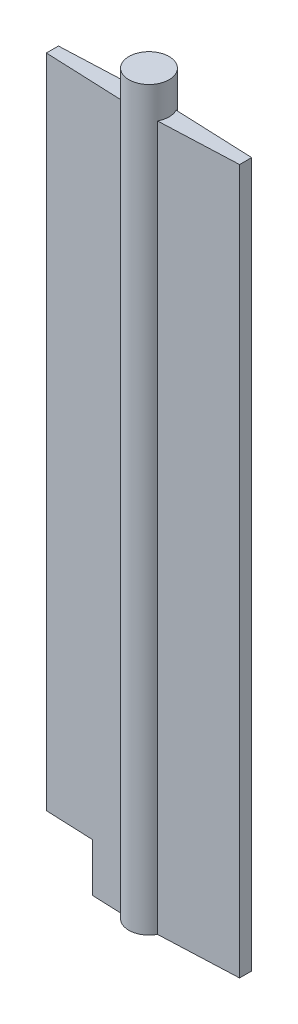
from build123d import *

# Parameters (mm, degrees)
SKETCH1_R               = 6.35
BOSS_EXTRUDE1_DEPTH     = 222.25
SKETCH2_R               = 6.35
BOSS_EXTRUDE2_DEPTH     = 10.16
CUT_EXTRUDE1_DEPTH      = 235.486163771
CUT_EXTRUDE1_DEPTH_BACK = 235.486163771
SKETCH3_W               = 15.24
SKETCH3_H               = 15.24


with BuildPart() as part:
    # Sketch1 → Boss-Extrude1 (new body)
    with BuildSketch(Plane(origin=(0, 0, 0), x_dir=(1, 0, 0), z_dir=(0, 1, 0))):
        Circle(SKETCH1_R)
        Polygon((0, 3.175), (30.48, 1.905), (30.48, -1.905), (0, -3.175), (-30.48, -1.905), (-30.48, 1.905), align=None)
    extrude(amount=BOSS_EXTRUDE1_DEPTH)

    # Sketch2 → Boss-Extrude2 (add)
    with BuildSketch(Plane(origin=(0, 222.25, 0), x_dir=(1, 0, 0), z_dir=(0, 1, 0))):
        with Locations(Location((0, 0, 0), (0, 0, 27.5853824))):
            Circle(SKETCH2_R)
    extrude(amount=BOSS_EXTRUDE2_DEPTH)

    # Sketch3 → Cut-Extrude1 (cut, two sides: drawn at the far end of the back side and taken through both)
    with BuildSketch(Plane.XY.offset(-CUT_EXTRUDE1_DEPTH_BACK)):
        with Locations((-22.86, 7.62)):
            Rectangle(SKETCH3_W, SKETCH3_H)
    extrude(amount=CUT_EXTRUDE1_DEPTH + CUT_EXTRUDE1_DEPTH_BACK, mode=Mode.SUBTRACT)


solid = part.part
